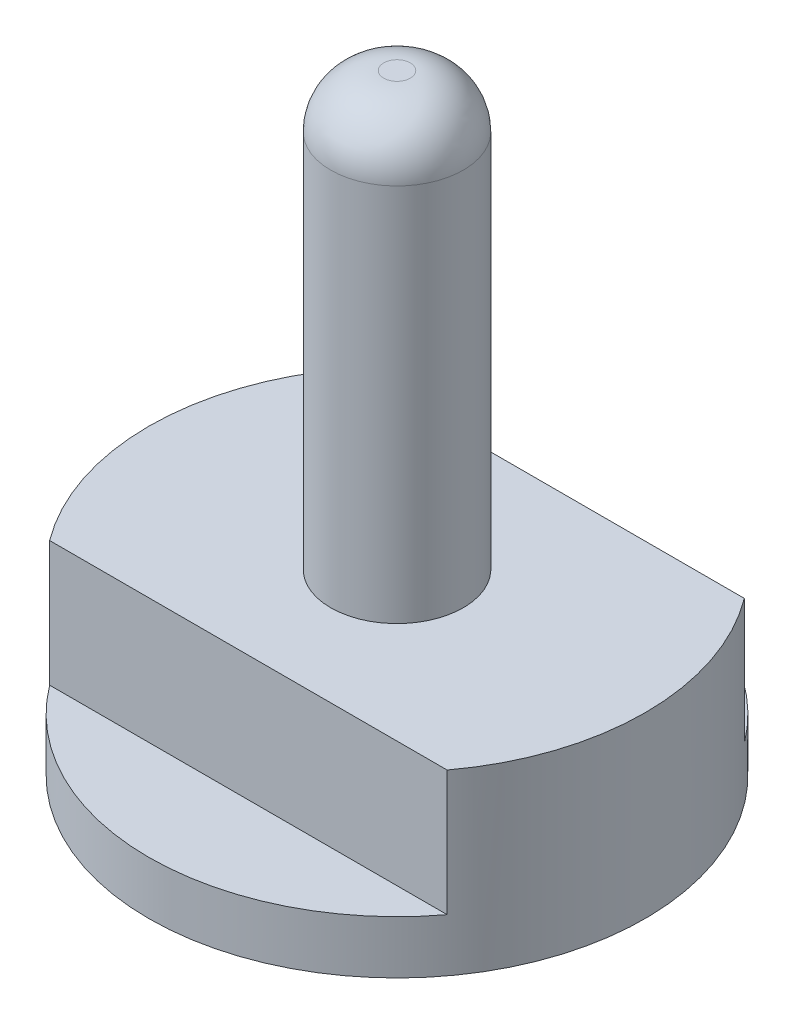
ISO-10303-21;
HEADER;
FILE_DESCRIPTION(('STEP AP214'),'2;1');
FILE_NAME('part.step','',(''),(''),'','','');
FILE_SCHEMA(('AUTOMOTIVE_DESIGN { 1 0 10303 214 1 1 1 1 }'));
ENDSEC;
DATA;
#1=APPLICATION_CONTEXT('core data for automotive mechanical design processes');
#2=APPLICATION_PROTOCOL_DEFINITION('international standard','automotive_design',2000,#1);
#3=PRODUCT_CONTEXT('',#1,'mechanical');
#4=PRODUCT('Part','Part','',(#3));
#5=PRODUCT_RELATED_PRODUCT_CATEGORY('part','',(#4));
#6=PRODUCT_DEFINITION_FORMATION('','',#4);
#7=PRODUCT_DEFINITION_CONTEXT('part definition',#1,'design');
#8=PRODUCT_DEFINITION('design','',#6,#7);
#9=PRODUCT_DEFINITION_SHAPE('','',#8);
#10=(LENGTH_UNIT() NAMED_UNIT(*) SI_UNIT(.MILLI.,.METRE.));
#11=(NAMED_UNIT(*) PLANE_ANGLE_UNIT() SI_UNIT($,.RADIAN.));
#12=(NAMED_UNIT(*) SI_UNIT($,.STERADIAN.) SOLID_ANGLE_UNIT());
#13=UNCERTAINTY_MEASURE_WITH_UNIT(LENGTH_MEASURE(1.E-05),#10,'distance_accuracy_value','');
#14=(GEOMETRIC_REPRESENTATION_CONTEXT(3) GLOBAL_UNCERTAINTY_ASSIGNED_CONTEXT((#13)) GLOBAL_UNIT_ASSIGNED_CONTEXT((#10,
#11,#12)) REPRESENTATION_CONTEXT('',''));
#15=CARTESIAN_POINT('',(0.,0.,0.));
#16=DIRECTION('',(0.,0.,1.));
#17=DIRECTION('',(1.,0.,0.));
#18=AXIS2_PLACEMENT_3D('',#15,#16,#17);
#19=CARTESIAN_POINT('',(2.35922392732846E-13,0.,2.79999999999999));
#20=DIRECTION('',(0.,1.,0.));
#21=DIRECTION('',(-1.,0.,0.));
#22=AXIS2_PLACEMENT_3D('',#19,#20,#21);
#23=PLANE('',#22);
#24=CARTESIAN_POINT('',(2.35922392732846E-13,0.,2.79999999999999));
#25=DIRECTION('',(0.,1.,0.));
#26=DIRECTION('',(0.,0.,1.));
#27=AXIS2_PLACEMENT_3D('',#24,#25,#26);
#28=CIRCLE('',#27,4.675);
#29=CARTESIAN_POINT('',(2.35922392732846E-13,0.,7.47499999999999));
#30=VERTEX_POINT('',#29);
#31=EDGE_CURVE('E95',#30,#30,#28,.F.);
#32=ORIENTED_EDGE('',*,*,#31,.T.);
#33=EDGE_LOOP('',(#32));
#34=FACE_BOUND('',#33,.T.);
#35=CARTESIAN_POINT('',(2.42861286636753E-13,0.,2.79999999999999));
#36=DIRECTION('',(0.,-1.,0.));
#37=DIRECTION('',(0.,0.,-1.));
#38=AXIS2_PLACEMENT_3D('',#35,#36,#37);
#39=CIRCLE('',#38,1.67500000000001);
#40=CARTESIAN_POINT('',(2.42861286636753E-13,0.,1.12499999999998));
#41=VERTEX_POINT('',#40);
#42=EDGE_CURVE('E11',#41,#41,#39,.T.);
#43=ORIENTED_EDGE('',*,*,#42,.F.);
#44=EDGE_LOOP('',(#43));
#45=FACE_BOUND('',#44,.T.);
#46=ADVANCED_FACE('F32',(#34,#45),#23,.F.);
#47=CARTESIAN_POINT('',(3.74374478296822,-10.8987384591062,5.6));
#48=DIRECTION('',(0.,0.,-1.));
#49=DIRECTION('',(0.,1.,0.));
#50=AXIS2_PLACEMENT_3D('',#47,#48,#49);
#51=PLANE('',#50);
#52=DIRECTION('',(-1.,0.,0.));
#53=VECTOR('',#52,1.);
#54=CARTESIAN_POINT('',(3.74374478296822,1.,5.6));
#55=LINE('',#54,#53);
#56=CARTESIAN_POINT('',(3.74374478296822,1.,5.6));
#57=VERTEX_POINT('',#56);
#58=CARTESIAN_POINT('',(-3.74374478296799,1.,5.6));
#59=VERTEX_POINT('',#58);
#60=EDGE_CURVE('E48',#57,#59,#55,.T.);
#61=ORIENTED_EDGE('',*,*,#60,.F.);
#62=DIRECTION('',(0.,1.,0.));
#63=VECTOR('',#62,1.);
#64=CARTESIAN_POINT('',(3.74374478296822,-10.8987384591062,5.6));
#65=LINE('',#64,#63);
#66=CARTESIAN_POINT('',(3.74374478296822,3.35999999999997,5.6));
#67=VERTEX_POINT('',#66);
#68=EDGE_CURVE('E93',#57,#67,#65,.T.);
#69=ORIENTED_EDGE('',*,*,#68,.T.);
#70=DIRECTION('',(-1.,0.,0.));
#71=VECTOR('',#70,1.);
#72=CARTESIAN_POINT('',(3.74374478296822,3.35999999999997,5.6));
#73=LINE('',#72,#71);
#74=CARTESIAN_POINT('',(-3.74374478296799,3.35999999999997,5.6));
#75=VERTEX_POINT('',#74);
#76=EDGE_CURVE('E116',#67,#75,#73,.T.);
#77=ORIENTED_EDGE('',*,*,#76,.T.);
#78=DIRECTION('',(0.,1.,0.));
#79=VECTOR('',#78,1.);
#80=CARTESIAN_POINT('',(-3.74374478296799,-10.8987384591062,5.6));
#81=LINE('',#80,#79);
#82=EDGE_CURVE('E53',#59,#75,#81,.T.);
#83=ORIENTED_EDGE('',*,*,#82,.F.);
#84=EDGE_LOOP('',(#61,#69,#77,#83));
#85=FACE_BOUND('',#84,.T.);
#86=ADVANCED_FACE('F125',(#85),#51,.F.);
#87=CARTESIAN_POINT('',(3.74374478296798,-10.8987384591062,0.));
#88=DIRECTION('',(0.,0.,-1.));
#89=DIRECTION('',(0.,1.,0.));
#90=AXIS2_PLACEMENT_3D('',#87,#88,#89);
#91=PLANE('',#90);
#92=DIRECTION('',(0.,1.,0.));
#93=VECTOR('',#92,1.);
#94=CARTESIAN_POINT('',(3.74374478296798,-10.8987384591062,0.));
#95=LINE('',#94,#93);
#96=CARTESIAN_POINT('',(3.743744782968,1.,0.));
#97=VERTEX_POINT('',#96);
#98=CARTESIAN_POINT('',(3.74374478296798,3.35999999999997,0.));
#99=VERTEX_POINT('',#98);
#100=EDGE_CURVE('E84',#97,#99,#95,.T.);
#101=ORIENTED_EDGE('',*,*,#100,.F.);
#102=DIRECTION('',(-1.,0.,0.));
#103=VECTOR('',#102,1.);
#104=CARTESIAN_POINT('',(3.74374478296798,1.,0.));
#105=LINE('',#104,#103);
#106=CARTESIAN_POINT('',(-3.74374478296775,1.,0.));
#107=VERTEX_POINT('',#106);
#108=EDGE_CURVE('E71',#97,#107,#105,.T.);
#109=ORIENTED_EDGE('',*,*,#108,.T.);
#110=DIRECTION('',(0.,1.,0.));
#111=VECTOR('',#110,1.);
#112=CARTESIAN_POINT('',(-3.74374478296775,-10.8987384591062,0.));
#113=LINE('',#112,#111);
#114=CARTESIAN_POINT('',(-3.74374478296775,3.35999999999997,0.));
#115=VERTEX_POINT('',#114);
#116=EDGE_CURVE('E87',#107,#115,#113,.T.);
#117=ORIENTED_EDGE('',*,*,#116,.T.);
#118=DIRECTION('',(-1.,0.,0.));
#119=VECTOR('',#118,1.);
#120=CARTESIAN_POINT('',(3.74374478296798,3.35999999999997,0.));
#121=LINE('',#120,#119);
#122=EDGE_CURVE('E92',#99,#115,#121,.T.);
#123=ORIENTED_EDGE('',*,*,#122,.F.);
#124=EDGE_LOOP('',(#101,#109,#117,#123));
#125=FACE_BOUND('',#124,.T.);
#126=ADVANCED_FACE('F34',(#125),#91,.T.);
#127=CARTESIAN_POINT('',(2.35922392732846E-13,3.35999999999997,2.79999999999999));
#128=DIRECTION('',(0.,1.,0.));
#129=DIRECTION('',(0.,0.,1.));
#130=AXIS2_PLACEMENT_3D('',#127,#128,#129);
#131=PLANE('',#130);
#132=CARTESIAN_POINT('',(2.42861286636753E-13,3.35999999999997,2.79999999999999));
#133=DIRECTION('',(0.,1.,0.));
#134=DIRECTION('',(0.,0.,1.));
#135=AXIS2_PLACEMENT_3D('',#132,#133,#134);
#136=CIRCLE('',#135,1.25);
#137=CARTESIAN_POINT('',(2.42861286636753E-13,3.35999999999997,4.04999999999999));
#138=VERTEX_POINT('',#137);
#139=EDGE_CURVE('E101',#138,#138,#136,.T.);
#140=ORIENTED_EDGE('',*,*,#139,.F.);
#141=EDGE_LOOP('',(#140));
#142=FACE_BOUND('',#141,.T.);
#143=CARTESIAN_POINT('',(2.35922392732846E-13,3.35999999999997,2.79999999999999));
#144=DIRECTION('',(0.,1.,0.));
#145=DIRECTION('',(0.,0.,1.));
#146=AXIS2_PLACEMENT_3D('',#143,#144,#145);
#147=CIRCLE('',#146,4.675);
#148=EDGE_CURVE('E113',#115,#75,#147,.T.);
#149=ORIENTED_EDGE('',*,*,#148,.T.);
#150=ORIENTED_EDGE('',*,*,#76,.F.);
#151=CARTESIAN_POINT('',(2.35922392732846E-13,3.35999999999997,2.79999999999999));
#152=DIRECTION('',(0.,1.,0.));
#153=DIRECTION('',(0.,0.,1.));
#154=AXIS2_PLACEMENT_3D('',#151,#152,#153);
#155=CIRCLE('',#154,4.675);
#156=EDGE_CURVE('E118',#67,#99,#155,.T.);
#157=ORIENTED_EDGE('',*,*,#156,.T.);
#158=ORIENTED_EDGE('',*,*,#122,.T.);
#159=EDGE_LOOP('',(#149,#150,#157,#158));
#160=FACE_BOUND('',#159,.T.);
#161=ADVANCED_FACE('F124',(#142,#160),#131,.T.);
#162=CARTESIAN_POINT('',(2.35922392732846E-13,-10.8987384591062,2.79999999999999));
#163=DIRECTION('',(0.,1.,0.));
#164=DIRECTION('',(0.,0.,1.));
#165=AXIS2_PLACEMENT_3D('',#162,#163,#164);
#166=CYLINDRICAL_SURFACE('',#165,4.675);
#167=ORIENTED_EDGE('',*,*,#68,.F.);
#168=CARTESIAN_POINT('',(2.42861286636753E-13,1.,2.79999999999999));
#169=DIRECTION('',(0.,-1.,0.));
#170=DIRECTION('',(0.,0.,-1.));
#171=AXIS2_PLACEMENT_3D('',#168,#169,#170);
#172=CIRCLE('',#171,4.67500000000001);
#173=EDGE_CURVE('E78',#57,#59,#172,.T.);
#174=ORIENTED_EDGE('',*,*,#173,.T.);
#175=ORIENTED_EDGE('',*,*,#82,.T.);
#176=ORIENTED_EDGE('',*,*,#148,.F.);
#177=ORIENTED_EDGE('',*,*,#116,.F.);
#178=EDGE_CURVE('E74',#107,#97,#172,.T.);
#179=ORIENTED_EDGE('',*,*,#178,.T.);
#180=ORIENTED_EDGE('',*,*,#100,.T.);
#181=ORIENTED_EDGE('',*,*,#156,.F.);
#182=EDGE_LOOP('',(#167,#174,#175,#176,#177,#179,#180,#181));
#183=FACE_BOUND('',#182,.T.);
#184=ORIENTED_EDGE('',*,*,#31,.F.);
#185=EDGE_LOOP('',(#184));
#186=FACE_BOUND('',#185,.T.);
#187=ADVANCED_FACE('F81',(#183,#186),#166,.T.);
#188=CARTESIAN_POINT('',(2.42861286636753E-13,11.5,2.79999999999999));
#189=DIRECTION('',(0.,-1.,0.));
#190=DIRECTION('',(0.,0.,-1.));
#191=AXIS2_PLACEMENT_3D('',#188,#189,#190);
#192=CYLINDRICAL_SURFACE('',#191,1.25);
#193=CARTESIAN_POINT('',(2.42861286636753E-13,10.5,2.79999999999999));
#194=DIRECTION('',(0.,1.,0.));
#195=DIRECTION('',(0.,0.,1.));
#196=AXIS2_PLACEMENT_3D('',#193,#194,#195);
#197=CIRCLE('',#196,1.25);
#198=CARTESIAN_POINT('',(2.42861286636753E-13,10.5,4.04999999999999));
#199=VERTEX_POINT('',#198);
#200=EDGE_CURVE('E36',#199,#199,#197,.F.);
#201=ORIENTED_EDGE('',*,*,#200,.T.);
#202=EDGE_LOOP('',(#201));
#203=FACE_BOUND('',#202,.T.);
#204=ORIENTED_EDGE('',*,*,#139,.T.);
#205=EDGE_LOOP('',(#204));
#206=FACE_BOUND('',#205,.T.);
#207=ADVANCED_FACE('F163',(#203,#206),#192,.T.);
#208=CARTESIAN_POINT('',(2.42861286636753E-13,11.5,2.79999999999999));
#209=DIRECTION('',(0.,1.,0.));
#210=DIRECTION('',(0.,0.,1.));
#211=AXIS2_PLACEMENT_3D('',#208,#209,#210);
#212=PLANE('',#211);
#213=CARTESIAN_POINT('',(2.42861286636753E-13,11.5,2.79999999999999));
#214=DIRECTION('',(0.,1.,0.));
#215=DIRECTION('',(0.,0.,1.));
#216=AXIS2_PLACEMENT_3D('',#213,#214,#215);
#217=CIRCLE('',#216,0.25);
#218=CARTESIAN_POINT('',(2.42861286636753E-13,11.5,3.04999999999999));
#219=VERTEX_POINT('',#218);
#220=EDGE_CURVE('E99',#219,#219,#217,.T.);
#221=ORIENTED_EDGE('',*,*,#220,.T.);
#222=EDGE_LOOP('',(#221));
#223=FACE_BOUND('',#222,.T.);
#224=ADVANCED_FACE('F168',(#223),#212,.T.);
#225=CARTESIAN_POINT('',(2.42861286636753E-13,10.5,2.79999999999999));
#226=DIRECTION('',(0.,1.,0.));
#227=DIRECTION('',(0.,0.,1.));
#228=AXIS2_PLACEMENT_3D('',#225,#226,#227);
#229=DEGENERATE_TOROIDAL_SURFACE('',#228,0.25,1.,.T.);
#230=ORIENTED_EDGE('',*,*,#200,.F.);
#231=EDGE_LOOP('',(#230));
#232=FACE_BOUND('',#231,.T.);
#233=ORIENTED_EDGE('',*,*,#220,.F.);
#234=EDGE_LOOP('',(#233));
#235=FACE_BOUND('',#234,.T.);
#236=ADVANCED_FACE('F173',(#232,#235),#229,.T.);
#237=CARTESIAN_POINT('',(2.42861286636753E-13,1.,2.79999999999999));
#238=DIRECTION('',(0.,-1.,0.));
#239=DIRECTION('',(0.,0.,-1.));
#240=AXIS2_PLACEMENT_3D('',#237,#238,#239);
#241=PLANE('',#240);
#242=ORIENTED_EDGE('',*,*,#108,.F.);
#243=ORIENTED_EDGE('',*,*,#178,.F.);
#244=EDGE_LOOP('',(#242,#243));
#245=FACE_BOUND('',#244,.T.);
#246=ADVANCED_FACE('F73',(#245),#241,.F.);
#247=ORIENTED_EDGE('',*,*,#173,.F.);
#248=ORIENTED_EDGE('',*,*,#60,.T.);
#249=EDGE_LOOP('',(#247,#248));
#250=FACE_BOUND('',#249,.T.);
#251=ADVANCED_FACE('F127',(#250),#241,.F.);
#252=CARTESIAN_POINT('',(2.42861286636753E-13,-2.,2.79999999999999));
#253=DIRECTION('',(0.,-1.,0.));
#254=DIRECTION('',(0.,0.,-1.));
#255=AXIS2_PLACEMENT_3D('',#252,#253,#254);
#256=PLANE('',#255);
#257=CARTESIAN_POINT('',(2.42861286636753E-13,-2.,2.79999999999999));
#258=DIRECTION('',(0.,-1.,0.));
#259=DIRECTION('',(0.,0.,-1.));
#260=AXIS2_PLACEMENT_3D('',#257,#258,#259);
#261=CIRCLE('',#260,1.67500000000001);
#262=CARTESIAN_POINT('',(2.42861286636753E-13,-2.,1.12499999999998));
#263=VERTEX_POINT('',#262);
#264=EDGE_CURVE('E88',#263,#263,#261,.T.);
#265=ORIENTED_EDGE('',*,*,#264,.T.);
#266=EDGE_LOOP('',(#265));
#267=FACE_BOUND('',#266,.T.);
#268=CARTESIAN_POINT('',(2.42861286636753E-13,-2.,2.79999999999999));
#269=DIRECTION('',(0.,-1.,0.));
#270=DIRECTION('',(0.,0.,-1.));
#271=AXIS2_PLACEMENT_3D('',#268,#269,#270);
#272=CIRCLE('',#271,1.17500000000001);
#273=CARTESIAN_POINT('',(2.42861286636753E-13,-2.,1.62499999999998));
#274=VERTEX_POINT('',#273);
#275=EDGE_CURVE('E130',#274,#274,#272,.T.);
#276=ORIENTED_EDGE('',*,*,#275,.F.);
#277=EDGE_LOOP('',(#276));
#278=FACE_BOUND('',#277,.T.);
#279=ADVANCED_FACE('F150',(#267,#278),#256,.T.);
#280=CARTESIAN_POINT('',(2.42861286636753E-13,-2.,2.79999999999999));
#281=DIRECTION('',(0.,1.,0.));
#282=DIRECTION('',(0.,0.,1.));
#283=AXIS2_PLACEMENT_3D('',#280,#281,#282);
#284=CYLINDRICAL_SURFACE('',#283,1.67500000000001);
#285=ORIENTED_EDGE('',*,*,#264,.F.);
#286=EDGE_LOOP('',(#285));
#287=FACE_BOUND('',#286,.T.);
#288=ORIENTED_EDGE('',*,*,#42,.T.);
#289=EDGE_LOOP('',(#288));
#290=FACE_BOUND('',#289,.T.);
#291=ADVANCED_FACE('F142',(#287,#290),#284,.T.);
#292=CARTESIAN_POINT('',(2.42861286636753E-13,-2.,2.79999999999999));
#293=DIRECTION('',(0.,1.,0.));
#294=DIRECTION('',(0.,0.,1.));
#295=AXIS2_PLACEMENT_3D('',#292,#293,#294);
#296=CYLINDRICAL_SURFACE('',#295,1.17500000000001);
#297=ORIENTED_EDGE('',*,*,#275,.T.);
#298=EDGE_LOOP('',(#297));
#299=FACE_BOUND('',#298,.T.);
#300=CARTESIAN_POINT('',(2.42861286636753E-13,0.,2.79999999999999));
#301=DIRECTION('',(0.,-1.,0.));
#302=DIRECTION('',(0.,0.,-1.));
#303=AXIS2_PLACEMENT_3D('',#300,#301,#302);
#304=CIRCLE('',#303,1.17500000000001);
#305=CARTESIAN_POINT('',(2.42861286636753E-13,0.,1.62499999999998));
#306=VERTEX_POINT('',#305);
#307=EDGE_CURVE('E134',#306,#306,#304,.T.);
#308=ORIENTED_EDGE('',*,*,#307,.F.);
#309=EDGE_LOOP('',(#308));
#310=FACE_BOUND('',#309,.T.);
#311=ADVANCED_FACE('F140',(#299,#310),#296,.F.);
#312=ORIENTED_EDGE('',*,*,#307,.T.);
#313=EDGE_LOOP('',(#312));
#314=FACE_BOUND('',#313,.T.);
#315=ADVANCED_FACE('F138',(#314),#23,.F.);
#316=CLOSED_SHELL('',(#46,#86,#126,#161,#187,#207,#224,#236,#246,#251,#279,#291,#311,#315));
#317=MANIFOLD_SOLID_BREP('B2',#316);
#318=ADVANCED_BREP_SHAPE_REPRESENTATION('',(#18,#317),#14);
#319=SHAPE_DEFINITION_REPRESENTATION(#9,#318);
ENDSEC;
END-ISO-10303-21;
